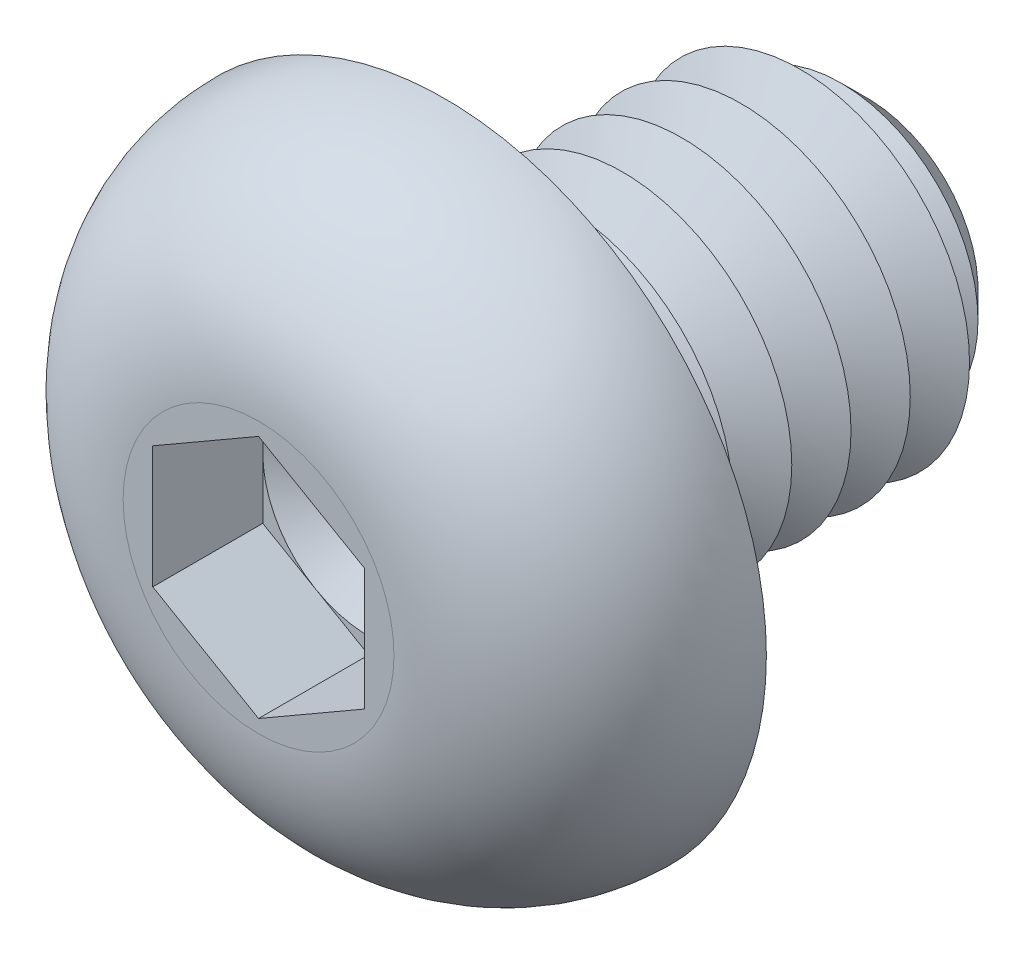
from build123d import *

# Parameters (mm, degrees)
CUT_EXTRUDE1_DEPTH  = 1.3
SKETCH4_R           = 2
BOSS_EXTRUDE1_DEPTH = 5
CHAMFER1_SIZE       = 0.7
LPATTERN1_COUNT     = 6
LPATTERN1_PITCH     = 0.7
FILLET2_R           = 0.3


with BuildPart() as part:
    # Sketch2 → Revolve1 (revolve)
    with BuildSketch(Plane(origin=(0, 0, 0), x_dir=(0, 0, -1), z_dir=(1, 0, 0)), mode=Mode.PRIVATE) as revolve1_sk:
        with BuildLine():
            Line((0, 0), (-2.2, 0))
            Line((-2.2, 0), (-2.2, 1.6))
            ThreePointArc((-2.2, 1.6), (-1.555634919, 3.155634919), (0, 3.8))
            Line((0, 3.8), (0, 0))
        make_face()
    revolve(revolve1_sk.sketch.rotate(Axis((0, 0, 47.934239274), (0, 0, -1)), 90), axis=Axis((0, 0, 47.934239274), (0, 0, -1)))

    # Sketch3 → Cut-Extrude1 (cut)
    with BuildSketch(Plane.XY.offset(2.2)):
        Polygon((0, 1.443375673), (-1.25, 0.721687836), (-1.25, -0.721687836), (0, -1.443375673), (1.25, -0.721687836), (1.25, 0.721687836), align=None)
    extrude(amount=-CUT_EXTRUDE1_DEPTH, mode=Mode.SUBTRACT)

    # Sketch4 → Boss-Extrude1 (add)
    with BuildSketch(Plane(origin=(0, 0, 0), x_dir=(-1, 0, 0), z_dir=(0, 0, -1))):
        with Locations(Location((0, 0, 0), (0, 0, 180))):
            Circle(SKETCH4_R)
    extrude(amount=BOSS_EXTRUDE1_DEPTH)

    # Chamfer1
    chamfer1_edges = [part.edges().sort_by_distance(p)[0] for p in [
        (-2, 0, -5),
    ]]
    chamfer(chamfer1_edges, length=CHAMFER1_SIZE)

    # Sketch5 → Cut-Revolve1 (revolve, cut)
    with BuildSketch(Plane(origin=(0, 0, 0), x_dir=(0, 0, -1), z_dir=(1, 0, 0)), mode=Mode.PRIVATE) as cut_revolve1_sk:
        Polygon((0.7, 2), (1.4, 2), (1.05, 1.393782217), align=None)
    cut_revolve1 = revolve(cut_revolve1_sk.sketch.rotate(Axis((0, 0, 47.934239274), (0, 0, -1)), 90), axis=Axis((0, 0, 47.934239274), (0, 0, -1)), mode=Mode.SUBTRACT)

    # LPattern1: Cut-Revolve1 ×6
    with Locations(*[(0, 0, -i * LPATTERN1_PITCH) for i in range(1, LPATTERN1_COUNT)]):
        add(cut_revolve1, mode=Mode.SUBTRACT)

    # Fillet2
    fillet2_edges = [part.edges().sort_by_distance(p)[0] for p in [
        (-2, 0, 0),
    ]]
    fillet(fillet2_edges, radius=FILLET2_R)

    # Cut-Extrude2 cone 1 section (on through the dimple's axis) → Cut-Extrude2 (revolve, cut)
    with BuildSketch(Plane(origin=(0, 0, 0.9), x_dir=(0, -1, 0), z_dir=(1, 0, 0))):
        Polygon((0, 0), (1.25, 0), (0, 0.721687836), align=None)
    revolve(axis=Axis((0, 0, 0.9), (0, 0, -1)), mode=Mode.SUBTRACT)


solid = part.part
